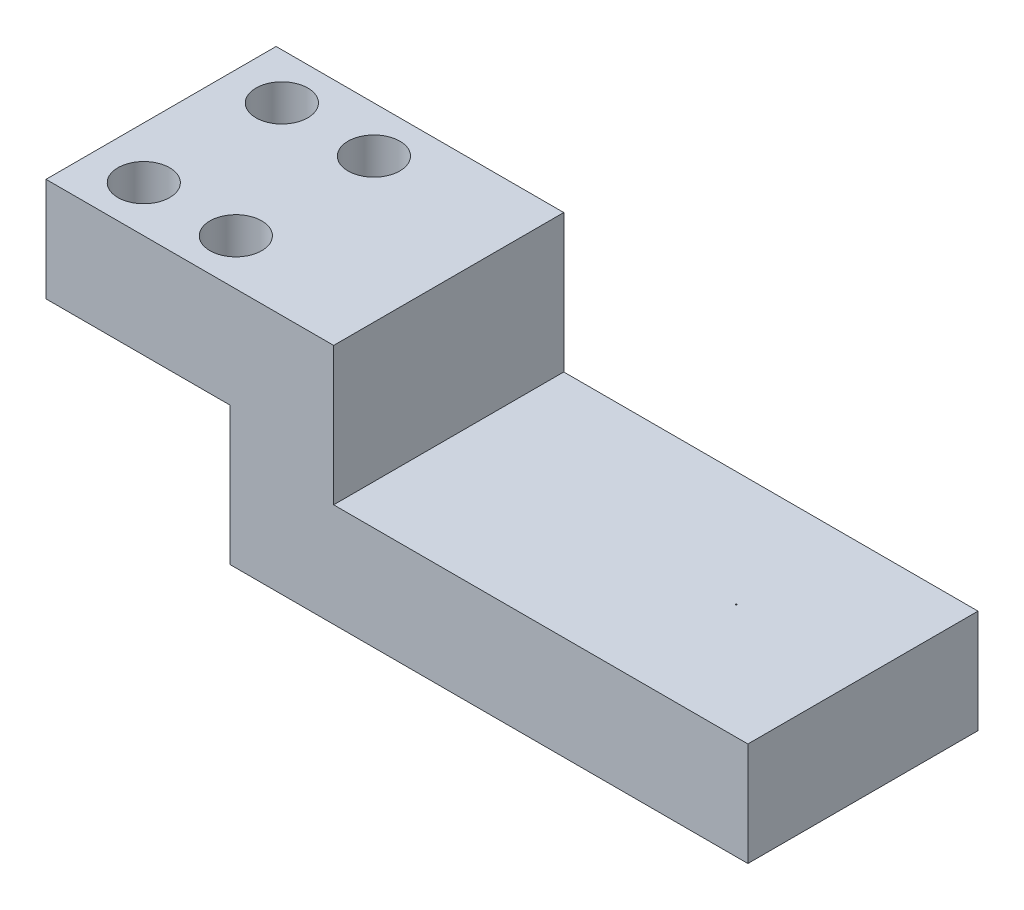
ISO-10303-21;
HEADER;
FILE_DESCRIPTION(('STEP AP214'),'2;1');
FILE_NAME('part.step','',(''),(''),'','','');
FILE_SCHEMA(('AUTOMOTIVE_DESIGN { 1 0 10303 214 1 1 1 1 }'));
ENDSEC;
DATA;
#1=APPLICATION_CONTEXT('core data for automotive mechanical design processes');
#2=APPLICATION_PROTOCOL_DEFINITION('international standard','automotive_design',2000,#1);
#3=PRODUCT_CONTEXT('',#1,'mechanical');
#4=PRODUCT('Part','Part','',(#3));
#5=PRODUCT_RELATED_PRODUCT_CATEGORY('part','',(#4));
#6=PRODUCT_DEFINITION_FORMATION('','',#4);
#7=PRODUCT_DEFINITION_CONTEXT('part definition',#1,'design');
#8=PRODUCT_DEFINITION('design','',#6,#7);
#9=PRODUCT_DEFINITION_SHAPE('','',#8);
#10=(LENGTH_UNIT() NAMED_UNIT(*) SI_UNIT(.MILLI.,.METRE.));
#11=(NAMED_UNIT(*) PLANE_ANGLE_UNIT() SI_UNIT($,.RADIAN.));
#12=(NAMED_UNIT(*) SI_UNIT($,.STERADIAN.) SOLID_ANGLE_UNIT());
#13=UNCERTAINTY_MEASURE_WITH_UNIT(LENGTH_MEASURE(1.E-05),#10,'distance_accuracy_value','');
#14=(GEOMETRIC_REPRESENTATION_CONTEXT(3) GLOBAL_UNCERTAINTY_ASSIGNED_CONTEXT((#13)) GLOBAL_UNIT_ASSIGNED_CONTEXT((#10,
#11,#12)) REPRESENTATION_CONTEXT('',''));
#15=CARTESIAN_POINT('',(0.,0.,0.));
#16=DIRECTION('',(0.,0.,1.));
#17=DIRECTION('',(1.,0.,0.));
#18=AXIS2_PLACEMENT_3D('',#15,#16,#17);
#19=CARTESIAN_POINT('',(0.,-9.00000000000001,10.));
#20=DIRECTION('',(1.,0.,0.));
#21=DIRECTION('',(0.,0.,-1.));
#22=AXIS2_PLACEMENT_3D('',#19,#20,#21);
#23=PLANE('',#22);
#24=DIRECTION('',(0.,-1.,0.));
#25=VECTOR('',#24,1.);
#26=CARTESIAN_POINT('',(0.,-9.,-10.));
#27=LINE('',#26,#25);
#28=CARTESIAN_POINT('',(0.,0.,-10.));
#29=VERTEX_POINT('',#28);
#30=CARTESIAN_POINT('',(0.,-9.,-10.));
#31=VERTEX_POINT('',#30);
#32=EDGE_CURVE('E107',#29,#31,#27,.T.);
#33=ORIENTED_EDGE('',*,*,#32,.T.);
#34=DIRECTION('',(0.,0.,-1.));
#35=VECTOR('',#34,1.);
#36=CARTESIAN_POINT('',(0.,-9.00000000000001,10.));
#37=LINE('',#36,#35);
#38=CARTESIAN_POINT('',(0.,-9.00000000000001,10.));
#39=VERTEX_POINT('',#38);
#40=EDGE_CURVE('E11',#39,#31,#37,.T.);
#41=ORIENTED_EDGE('',*,*,#40,.F.);
#42=DIRECTION('',(0.,-1.,0.));
#43=VECTOR('',#42,1.);
#44=CARTESIAN_POINT('',(0.,-9.00000000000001,10.));
#45=LINE('',#44,#43);
#46=CARTESIAN_POINT('',(0.,0.,10.));
#47=VERTEX_POINT('',#46);
#48=EDGE_CURVE('E139',#47,#39,#45,.T.);
#49=ORIENTED_EDGE('',*,*,#48,.F.);
#50=DIRECTION('',(0.,0.,-1.));
#51=VECTOR('',#50,1.);
#52=CARTESIAN_POINT('',(0.,0.,10.));
#53=LINE('',#52,#51);
#54=EDGE_CURVE('E120',#47,#29,#53,.T.);
#55=ORIENTED_EDGE('',*,*,#54,.T.);
#56=EDGE_LOOP('',(#33,#41,#49,#55));
#57=FACE_BOUND('',#56,.T.);
#58=ADVANCED_FACE('F39',(#57),#23,.F.);
#59=CARTESIAN_POINT('',(16.,-9.00000000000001,10.));
#60=DIRECTION('',(0.,1.,0.));
#61=DIRECTION('',(0.,0.,1.));
#62=AXIS2_PLACEMENT_3D('',#59,#60,#61);
#63=PLANE('',#62);
#64=CARTESIAN_POINT('',(12.5,-9.,5.99999999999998));
#65=DIRECTION('',(0.,1.,0.));
#66=DIRECTION('',(0.,0.,1.));
#67=AXIS2_PLACEMENT_3D('',#64,#65,#66);
#68=CIRCLE('',#67,2.25);
#69=CARTESIAN_POINT('',(12.5,-9.,8.24999999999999));
#70=VERTEX_POINT('',#69);
#71=EDGE_CURVE('E234',#70,#70,#68,.T.);
#72=ORIENTED_EDGE('',*,*,#71,.T.);
#73=EDGE_LOOP('',(#72));
#74=FACE_BOUND('',#73,.T.);
#75=CARTESIAN_POINT('',(4.5,-9.00000000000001,6.00000000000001));
#76=DIRECTION('',(0.,1.,0.));
#77=DIRECTION('',(0.,0.,1.));
#78=AXIS2_PLACEMENT_3D('',#75,#76,#77);
#79=CIRCLE('',#78,2.25);
#80=CARTESIAN_POINT('',(4.5,-9.00000000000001,8.25000000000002));
#81=VERTEX_POINT('',#80);
#82=EDGE_CURVE('E239',#81,#81,#79,.T.);
#83=ORIENTED_EDGE('',*,*,#82,.T.);
#84=EDGE_LOOP('',(#83));
#85=FACE_BOUND('',#84,.T.);
#86=CARTESIAN_POINT('',(12.5,-8.99999999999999,-6.00000000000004));
#87=DIRECTION('',(0.,1.,0.));
#88=DIRECTION('',(0.,0.,1.));
#89=AXIS2_PLACEMENT_3D('',#86,#87,#88);
#90=CIRCLE('',#89,2.25);
#91=CARTESIAN_POINT('',(12.5,-8.99999999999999,-3.75000000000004));
#92=VERTEX_POINT('',#91);
#93=EDGE_CURVE('E245',#92,#92,#90,.T.);
#94=ORIENTED_EDGE('',*,*,#93,.T.);
#95=EDGE_LOOP('',(#94));
#96=FACE_BOUND('',#95,.T.);
#97=CARTESIAN_POINT('',(4.49999999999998,-9.,-6.00000000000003));
#98=DIRECTION('',(0.,1.,0.));
#99=DIRECTION('',(0.,0.,1.));
#100=AXIS2_PLACEMENT_3D('',#97,#98,#99);
#101=CIRCLE('',#100,2.25);
#102=CARTESIAN_POINT('',(4.49999999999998,-9.,-3.75000000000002));
#103=VERTEX_POINT('',#102);
#104=EDGE_CURVE('E121',#103,#103,#101,.T.);
#105=ORIENTED_EDGE('',*,*,#104,.T.);
#106=EDGE_LOOP('',(#105));
#107=FACE_BOUND('',#106,.T.);
#108=DIRECTION('',(1.,0.,0.));
#109=VECTOR('',#108,1.);
#110=CARTESIAN_POINT('',(16.,-9.,-10.));
#111=LINE('',#110,#109);
#112=CARTESIAN_POINT('',(16.,-9.,-10.));
#113=VERTEX_POINT('',#112);
#114=EDGE_CURVE('E103',#31,#113,#111,.T.);
#115=ORIENTED_EDGE('',*,*,#114,.T.);
#116=DIRECTION('',(0.,0.,-1.));
#117=VECTOR('',#116,1.);
#118=CARTESIAN_POINT('',(16.,-9.00000000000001,10.));
#119=LINE('',#118,#117);
#120=CARTESIAN_POINT('',(16.,-9.00000000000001,10.));
#121=VERTEX_POINT('',#120);
#122=EDGE_CURVE('E46',#121,#113,#119,.T.);
#123=ORIENTED_EDGE('',*,*,#122,.F.);
#124=DIRECTION('',(1.,0.,0.));
#125=VECTOR('',#124,1.);
#126=CARTESIAN_POINT('',(16.,-9.00000000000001,10.));
#127=LINE('',#126,#125);
#128=EDGE_CURVE('E116',#39,#121,#127,.T.);
#129=ORIENTED_EDGE('',*,*,#128,.F.);
#130=ORIENTED_EDGE('',*,*,#40,.T.);
#131=EDGE_LOOP('',(#115,#123,#129,#130));
#132=FACE_BOUND('',#131,.T.);
#133=ADVANCED_FACE('F115',(#74,#85,#96,#107,#132),#63,.F.);
#134=CARTESIAN_POINT('',(16.0000000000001,-21.,10.));
#135=DIRECTION('',(1.,0.,0.));
#136=DIRECTION('',(0.,0.,-1.));
#137=AXIS2_PLACEMENT_3D('',#134,#135,#136);
#138=PLANE('',#137);
#139=DIRECTION('',(0.,-1.,0.));
#140=VECTOR('',#139,1.);
#141=CARTESIAN_POINT('',(16.,-21.,-10.));
#142=LINE('',#141,#140);
#143=CARTESIAN_POINT('',(16.,-21.,-10.));
#144=VERTEX_POINT('',#143);
#145=EDGE_CURVE('E109',#113,#144,#142,.T.);
#146=ORIENTED_EDGE('',*,*,#145,.T.);
#147=DIRECTION('',(0.,0.,-1.));
#148=VECTOR('',#147,1.);
#149=CARTESIAN_POINT('',(16.0000000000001,-21.,10.));
#150=LINE('',#149,#148);
#151=CARTESIAN_POINT('',(16.0000000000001,-21.,10.));
#152=VERTEX_POINT('',#151);
#153=EDGE_CURVE('E165',#152,#144,#150,.T.);
#154=ORIENTED_EDGE('',*,*,#153,.F.);
#155=DIRECTION('',(0.,-1.,0.));
#156=VECTOR('',#155,1.);
#157=CARTESIAN_POINT('',(16.0000000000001,-21.,10.));
#158=LINE('',#157,#156);
#159=EDGE_CURVE('E142',#121,#152,#158,.T.);
#160=ORIENTED_EDGE('',*,*,#159,.F.);
#161=ORIENTED_EDGE('',*,*,#122,.T.);
#162=EDGE_LOOP('',(#146,#154,#160,#161));
#163=FACE_BOUND('',#162,.T.);
#164=ADVANCED_FACE('F169',(#163),#138,.F.);
#165=CARTESIAN_POINT('',(61.0000000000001,-21.,10.));
#166=DIRECTION('',(0.,1.,0.));
#167=DIRECTION('',(-1.,0.,0.));
#168=AXIS2_PLACEMENT_3D('',#165,#166,#167);
#169=PLANE('',#168);
#170=DIRECTION('',(1.,0.,0.));
#171=VECTOR('',#170,1.);
#172=CARTESIAN_POINT('',(61.0000000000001,-21.,-10.));
#173=LINE('',#172,#171);
#174=CARTESIAN_POINT('',(61.0000000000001,-21.,-10.));
#175=VERTEX_POINT('',#174);
#176=EDGE_CURVE('E129',#144,#175,#173,.T.);
#177=ORIENTED_EDGE('',*,*,#176,.T.);
#178=DIRECTION('',(0.,0.,-1.));
#179=VECTOR('',#178,1.);
#180=CARTESIAN_POINT('',(61.0000000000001,-21.,10.));
#181=LINE('',#180,#179);
#182=CARTESIAN_POINT('',(61.0000000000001,-21.,10.));
#183=VERTEX_POINT('',#182);
#184=EDGE_CURVE('E162',#183,#175,#181,.T.);
#185=ORIENTED_EDGE('',*,*,#184,.F.);
#186=DIRECTION('',(1.,0.,0.));
#187=VECTOR('',#186,1.);
#188=CARTESIAN_POINT('',(61.0000000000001,-21.,10.));
#189=LINE('',#188,#187);
#190=EDGE_CURVE('E144',#152,#183,#189,.T.);
#191=ORIENTED_EDGE('',*,*,#190,.F.);
#192=ORIENTED_EDGE('',*,*,#153,.T.);
#193=EDGE_LOOP('',(#177,#185,#191,#192));
#194=FACE_BOUND('',#193,.T.);
#195=ADVANCED_FACE('F177',(#194),#169,.F.);
#196=CARTESIAN_POINT('',(61.0000000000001,-12.,10.));
#197=DIRECTION('',(-1.,0.,0.));
#198=DIRECTION('',(0.,0.,1.));
#199=AXIS2_PLACEMENT_3D('',#196,#197,#198);
#200=PLANE('',#199);
#201=DIRECTION('',(0.,1.,0.));
#202=VECTOR('',#201,1.);
#203=CARTESIAN_POINT('',(61.0000000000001,-12.,-10.));
#204=LINE('',#203,#202);
#205=CARTESIAN_POINT('',(61.0000000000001,-12.,-10.));
#206=VERTEX_POINT('',#205);
#207=EDGE_CURVE('E131',#175,#206,#204,.T.);
#208=ORIENTED_EDGE('',*,*,#207,.T.);
#209=DIRECTION('',(0.,0.,-1.));
#210=VECTOR('',#209,1.);
#211=CARTESIAN_POINT('',(61.0000000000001,-12.,10.));
#212=LINE('',#211,#210);
#213=CARTESIAN_POINT('',(61.0000000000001,-12.,10.));
#214=VERTEX_POINT('',#213);
#215=EDGE_CURVE('E159',#214,#206,#212,.T.);
#216=ORIENTED_EDGE('',*,*,#215,.F.);
#217=DIRECTION('',(0.,1.,0.));
#218=VECTOR('',#217,1.);
#219=CARTESIAN_POINT('',(61.0000000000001,-12.,10.));
#220=LINE('',#219,#218);
#221=EDGE_CURVE('E146',#183,#214,#220,.T.);
#222=ORIENTED_EDGE('',*,*,#221,.F.);
#223=ORIENTED_EDGE('',*,*,#184,.T.);
#224=EDGE_LOOP('',(#208,#216,#222,#223));
#225=FACE_BOUND('',#224,.T.);
#226=ADVANCED_FACE('F180',(#225),#200,.F.);
#227=CARTESIAN_POINT('',(25.0000000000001,-12.,10.));
#228=DIRECTION('',(0.,-1.,0.));
#229=DIRECTION('',(1.,0.,0.));
#230=AXIS2_PLACEMENT_3D('',#227,#228,#229);
#231=PLANE('',#230);
#232=CARTESIAN_POINT('',(50.0000000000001,-12.,0.));
#233=DIRECTION('',(0.,1.,0.));
#234=DIRECTION('',(-1.,0.,0.));
#235=AXIS2_PLACEMENT_3D('',#232,#233,#234);
#236=CIRCLE('',#235,0.050000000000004);
#237=CARTESIAN_POINT('',(49.9500000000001,-12.,0.));
#238=VERTEX_POINT('',#237);
#239=EDGE_CURVE('E224',#238,#238,#236,.T.);
#240=ORIENTED_EDGE('',*,*,#239,.F.);
#241=EDGE_LOOP('',(#240));
#242=FACE_BOUND('',#241,.T.);
#243=DIRECTION('',(-1.,0.,0.));
#244=VECTOR('',#243,1.);
#245=CARTESIAN_POINT('',(25.,-12.,-10.));
#246=LINE('',#245,#244);
#247=CARTESIAN_POINT('',(25.,-12.,-10.));
#248=VERTEX_POINT('',#247);
#249=EDGE_CURVE('E133',#206,#248,#246,.T.);
#250=ORIENTED_EDGE('',*,*,#249,.T.);
#251=DIRECTION('',(0.,0.,-1.));
#252=VECTOR('',#251,1.);
#253=CARTESIAN_POINT('',(25.0000000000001,-12.,10.));
#254=LINE('',#253,#252);
#255=CARTESIAN_POINT('',(25.0000000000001,-12.,10.));
#256=VERTEX_POINT('',#255);
#257=EDGE_CURVE('E156',#256,#248,#254,.T.);
#258=ORIENTED_EDGE('',*,*,#257,.F.);
#259=DIRECTION('',(-1.,0.,0.));
#260=VECTOR('',#259,1.);
#261=CARTESIAN_POINT('',(25.0000000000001,-12.,10.));
#262=LINE('',#261,#260);
#263=EDGE_CURVE('E148',#214,#256,#262,.T.);
#264=ORIENTED_EDGE('',*,*,#263,.F.);
#265=ORIENTED_EDGE('',*,*,#215,.T.);
#266=EDGE_LOOP('',(#250,#258,#264,#265));
#267=FACE_BOUND('',#266,.T.);
#268=ADVANCED_FACE('F185',(#242,#267),#231,.F.);
#269=CARTESIAN_POINT('',(25.0000000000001,0.,10.));
#270=DIRECTION('',(-1.,0.,0.));
#271=DIRECTION('',(0.,0.,1.));
#272=AXIS2_PLACEMENT_3D('',#269,#270,#271);
#273=PLANE('',#272);
#274=DIRECTION('',(0.,1.,0.));
#275=VECTOR('',#274,1.);
#276=CARTESIAN_POINT('',(25.,0.,-10.));
#277=LINE('',#276,#275);
#278=CARTESIAN_POINT('',(25.,0.,-10.));
#279=VERTEX_POINT('',#278);
#280=EDGE_CURVE('E135',#248,#279,#277,.T.);
#281=ORIENTED_EDGE('',*,*,#280,.T.);
#282=DIRECTION('',(0.,0.,-1.));
#283=VECTOR('',#282,1.);
#284=CARTESIAN_POINT('',(25.0000000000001,0.,10.));
#285=LINE('',#284,#283);
#286=CARTESIAN_POINT('',(25.0000000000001,0.,10.));
#287=VERTEX_POINT('',#286);
#288=EDGE_CURVE('E153',#287,#279,#285,.T.);
#289=ORIENTED_EDGE('',*,*,#288,.F.);
#290=DIRECTION('',(0.,1.,0.));
#291=VECTOR('',#290,1.);
#292=CARTESIAN_POINT('',(25.0000000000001,0.,10.));
#293=LINE('',#292,#291);
#294=EDGE_CURVE('E58',#256,#287,#293,.T.);
#295=ORIENTED_EDGE('',*,*,#294,.F.);
#296=ORIENTED_EDGE('',*,*,#257,.T.);
#297=EDGE_LOOP('',(#281,#289,#295,#296));
#298=FACE_BOUND('',#297,.T.);
#299=ADVANCED_FACE('F188',(#298),#273,.F.);
#300=CARTESIAN_POINT('',(0.,0.,10.));
#301=DIRECTION('',(0.,-1.,0.));
#302=DIRECTION('',(0.,0.,-1.));
#303=AXIS2_PLACEMENT_3D('',#300,#301,#302);
#304=PLANE('',#303);
#305=CARTESIAN_POINT('',(12.5,0.,5.99999999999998));
#306=DIRECTION('',(0.,1.,0.));
#307=DIRECTION('',(0.,0.,1.));
#308=AXIS2_PLACEMENT_3D('',#305,#306,#307);
#309=CIRCLE('',#308,2.25);
#310=CARTESIAN_POINT('',(12.5,0.,8.24999999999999));
#311=VERTEX_POINT('',#310);
#312=EDGE_CURVE('E229',#311,#311,#309,.T.);
#313=ORIENTED_EDGE('',*,*,#312,.F.);
#314=EDGE_LOOP('',(#313));
#315=FACE_BOUND('',#314,.T.);
#316=CARTESIAN_POINT('',(4.5,0.,6.00000000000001));
#317=DIRECTION('',(0.,1.,0.));
#318=DIRECTION('',(0.,0.,1.));
#319=AXIS2_PLACEMENT_3D('',#316,#317,#318);
#320=CIRCLE('',#319,2.25);
#321=CARTESIAN_POINT('',(4.5,0.,8.25000000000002));
#322=VERTEX_POINT('',#321);
#323=EDGE_CURVE('E236',#322,#322,#320,.T.);
#324=ORIENTED_EDGE('',*,*,#323,.F.);
#325=EDGE_LOOP('',(#324));
#326=FACE_BOUND('',#325,.T.);
#327=CARTESIAN_POINT('',(12.5,0.,-6.00000000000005));
#328=DIRECTION('',(0.,1.,0.));
#329=DIRECTION('',(0.,0.,1.));
#330=AXIS2_PLACEMENT_3D('',#327,#328,#329);
#331=CIRCLE('',#330,2.25);
#332=CARTESIAN_POINT('',(12.5,0.,-3.75000000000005));
#333=VERTEX_POINT('',#332);
#334=EDGE_CURVE('E242',#333,#333,#331,.T.);
#335=ORIENTED_EDGE('',*,*,#334,.F.);
#336=EDGE_LOOP('',(#335));
#337=FACE_BOUND('',#336,.T.);
#338=CARTESIAN_POINT('',(4.49999999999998,0.,-6.00000000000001));
#339=DIRECTION('',(0.,1.,0.));
#340=DIRECTION('',(0.,0.,1.));
#341=AXIS2_PLACEMENT_3D('',#338,#339,#340);
#342=CIRCLE('',#341,2.25);
#343=CARTESIAN_POINT('',(4.49999999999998,0.,-3.75000000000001));
#344=VERTEX_POINT('',#343);
#345=EDGE_CURVE('E124',#344,#344,#342,.T.);
#346=ORIENTED_EDGE('',*,*,#345,.F.);
#347=EDGE_LOOP('',(#346));
#348=FACE_BOUND('',#347,.T.);
#349=DIRECTION('',(-1.,0.,0.));
#350=VECTOR('',#349,1.);
#351=CARTESIAN_POINT('',(0.,0.,-10.));
#352=LINE('',#351,#350);
#353=EDGE_CURVE('E137',#279,#29,#352,.T.);
#354=ORIENTED_EDGE('',*,*,#353,.T.);
#355=ORIENTED_EDGE('',*,*,#54,.F.);
#356=DIRECTION('',(-1.,0.,0.));
#357=VECTOR('',#356,1.);
#358=CARTESIAN_POINT('',(0.,0.,10.));
#359=LINE('',#358,#357);
#360=EDGE_CURVE('E53',#287,#47,#359,.T.);
#361=ORIENTED_EDGE('',*,*,#360,.F.);
#362=ORIENTED_EDGE('',*,*,#288,.T.);
#363=EDGE_LOOP('',(#354,#355,#361,#362));
#364=FACE_BOUND('',#363,.T.);
#365=ADVANCED_FACE('F190',(#315,#326,#337,#348,#364),#304,.F.);
#366=CARTESIAN_POINT('',(0.,0.,10.));
#367=DIRECTION('',(0.,0.,-1.));
#368=DIRECTION('',(-1.,0.,0.));
#369=AXIS2_PLACEMENT_3D('',#366,#367,#368);
#370=PLANE('',#369);
#371=ORIENTED_EDGE('',*,*,#48,.T.);
#372=ORIENTED_EDGE('',*,*,#128,.T.);
#373=ORIENTED_EDGE('',*,*,#159,.T.);
#374=ORIENTED_EDGE('',*,*,#190,.T.);
#375=ORIENTED_EDGE('',*,*,#221,.T.);
#376=ORIENTED_EDGE('',*,*,#263,.T.);
#377=ORIENTED_EDGE('',*,*,#294,.T.);
#378=ORIENTED_EDGE('',*,*,#360,.T.);
#379=EDGE_LOOP('',(#371,#372,#373,#374,#375,#376,#377,#378));
#380=FACE_BOUND('',#379,.T.);
#381=ADVANCED_FACE('F172',(#380),#370,.F.);
#382=CARTESIAN_POINT('',(0.,0.,-10.));
#383=DIRECTION('',(0.,0.,-1.));
#384=DIRECTION('',(-1.,0.,0.));
#385=AXIS2_PLACEMENT_3D('',#382,#383,#384);
#386=PLANE('',#385);
#387=ORIENTED_EDGE('',*,*,#32,.F.);
#388=ORIENTED_EDGE('',*,*,#353,.F.);
#389=ORIENTED_EDGE('',*,*,#280,.F.);
#390=ORIENTED_EDGE('',*,*,#249,.F.);
#391=ORIENTED_EDGE('',*,*,#207,.F.);
#392=ORIENTED_EDGE('',*,*,#176,.F.);
#393=ORIENTED_EDGE('',*,*,#145,.F.);
#394=ORIENTED_EDGE('',*,*,#114,.F.);
#395=EDGE_LOOP('',(#387,#388,#389,#390,#391,#392,#393,#394));
#396=FACE_BOUND('',#395,.T.);
#397=ADVANCED_FACE('F104',(#396),#386,.T.);
#398=CARTESIAN_POINT('',(4.5,-21.,-6.00000000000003));
#399=DIRECTION('',(0.,1.,0.));
#400=DIRECTION('',(0.,0.,1.));
#401=AXIS2_PLACEMENT_3D('',#398,#399,#400);
#402=CYLINDRICAL_SURFACE('',#401,2.25);
#403=ORIENTED_EDGE('',*,*,#345,.T.);
#404=EDGE_LOOP('',(#403));
#405=FACE_BOUND('',#404,.T.);
#406=ORIENTED_EDGE('',*,*,#104,.F.);
#407=EDGE_LOOP('',(#406));
#408=FACE_BOUND('',#407,.T.);
#409=ADVANCED_FACE('F250',(#405,#408),#402,.F.);
#410=CARTESIAN_POINT('',(12.5,-21.,-6.00000000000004));
#411=DIRECTION('',(0.,1.,0.));
#412=DIRECTION('',(0.,0.,1.));
#413=AXIS2_PLACEMENT_3D('',#410,#411,#412);
#414=CYLINDRICAL_SURFACE('',#413,2.25);
#415=ORIENTED_EDGE('',*,*,#334,.T.);
#416=EDGE_LOOP('',(#415));
#417=FACE_BOUND('',#416,.T.);
#418=ORIENTED_EDGE('',*,*,#93,.F.);
#419=EDGE_LOOP('',(#418));
#420=FACE_BOUND('',#419,.T.);
#421=ADVANCED_FACE('F254',(#417,#420),#414,.F.);
#422=CARTESIAN_POINT('',(4.5,-21.,6.00000000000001));
#423=DIRECTION('',(0.,1.,0.));
#424=DIRECTION('',(0.,0.,1.));
#425=AXIS2_PLACEMENT_3D('',#422,#423,#424);
#426=CYLINDRICAL_SURFACE('',#425,2.25);
#427=ORIENTED_EDGE('',*,*,#323,.T.);
#428=EDGE_LOOP('',(#427));
#429=FACE_BOUND('',#428,.T.);
#430=ORIENTED_EDGE('',*,*,#82,.F.);
#431=EDGE_LOOP('',(#430));
#432=FACE_BOUND('',#431,.T.);
#433=ADVANCED_FACE('F262',(#429,#432),#426,.F.);
#434=CARTESIAN_POINT('',(12.5,-21.,5.99999999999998));
#435=DIRECTION('',(0.,1.,0.));
#436=DIRECTION('',(0.,0.,1.));
#437=AXIS2_PLACEMENT_3D('',#434,#435,#436);
#438=CYLINDRICAL_SURFACE('',#437,2.25);
#439=ORIENTED_EDGE('',*,*,#312,.T.);
#440=EDGE_LOOP('',(#439));
#441=FACE_BOUND('',#440,.T.);
#442=ORIENTED_EDGE('',*,*,#71,.F.);
#443=EDGE_LOOP('',(#442));
#444=FACE_BOUND('',#443,.T.);
#445=ADVANCED_FACE('F269',(#441,#444),#438,.F.);
#446=CARTESIAN_POINT('',(50.0000000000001,-12.1,0.));
#447=DIRECTION('',(0.,1.,0.));
#448=DIRECTION('',(-1.,0.,0.));
#449=AXIS2_PLACEMENT_3D('',#446,#447,#448);
#450=CYLINDRICAL_SURFACE('',#449,0.050000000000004);
#451=CARTESIAN_POINT('',(50.0000000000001,-12.1,0.));
#452=DIRECTION('',(0.,1.,0.));
#453=DIRECTION('',(-1.,0.,0.));
#454=AXIS2_PLACEMENT_3D('',#451,#452,#453);
#455=CIRCLE('',#454,0.050000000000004);
#456=CARTESIAN_POINT('',(49.9500000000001,-12.1,0.));
#457=VERTEX_POINT('',#456);
#458=EDGE_CURVE('E226',#457,#457,#455,.T.);
#459=ORIENTED_EDGE('',*,*,#458,.F.);
#460=EDGE_LOOP('',(#459));
#461=FACE_BOUND('',#460,.T.);
#462=ORIENTED_EDGE('',*,*,#239,.T.);
#463=EDGE_LOOP('',(#462));
#464=FACE_BOUND('',#463,.T.);
#465=ADVANCED_FACE('F273',(#461,#464),#450,.F.);
#466=CARTESIAN_POINT('',(50.0000000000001,-12.1,0.));
#467=DIRECTION('',(0.,1.,0.));
#468=DIRECTION('',(-1.,0.,0.));
#469=AXIS2_PLACEMENT_3D('',#466,#467,#468);
#470=PLANE('',#469);
#471=ORIENTED_EDGE('',*,*,#458,.T.);
#472=EDGE_LOOP('',(#471));
#473=FACE_BOUND('',#472,.T.);
#474=ADVANCED_FACE('F277',(#473),#470,.T.);
#475=CLOSED_SHELL('',(#58,#133,#164,#195,#226,#268,#299,#365,#381,#397,#409,#421,#433,#445,#465,#474));
#476=MANIFOLD_SOLID_BREP('B2',#475);
#477=ADVANCED_BREP_SHAPE_REPRESENTATION('',(#18,#476),#14);
#478=SHAPE_DEFINITION_REPRESENTATION(#9,#477);
ENDSEC;
END-ISO-10303-21;
